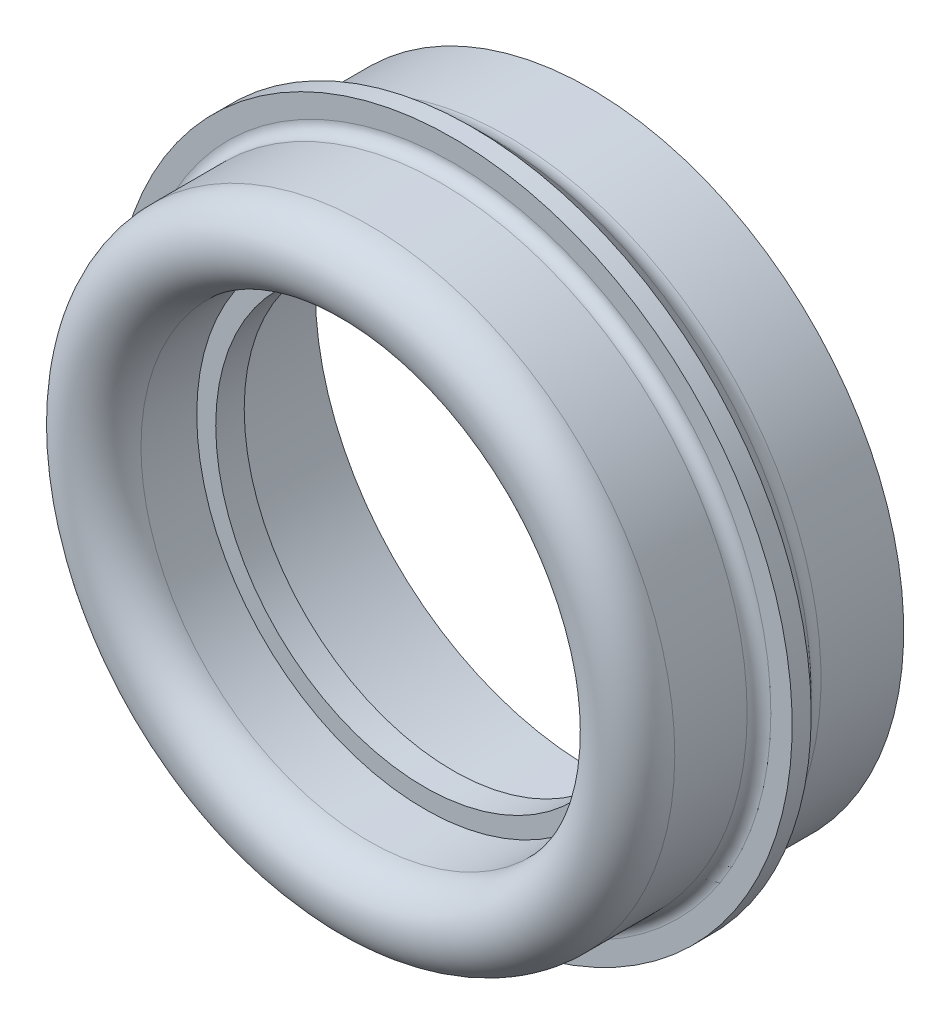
ISO-10303-21;
HEADER;
FILE_DESCRIPTION(('STEP AP214'),'2;1');
FILE_NAME('part.step','',(''),(''),'','','');
FILE_SCHEMA(('AUTOMOTIVE_DESIGN { 1 0 10303 214 1 1 1 1 }'));
ENDSEC;
DATA;
#1=APPLICATION_CONTEXT('core data for automotive mechanical design processes');
#2=APPLICATION_PROTOCOL_DEFINITION('international standard','automotive_design',2000,#1);
#3=PRODUCT_CONTEXT('',#1,'mechanical');
#4=PRODUCT('Part','Part','',(#3));
#5=PRODUCT_RELATED_PRODUCT_CATEGORY('part','',(#4));
#6=PRODUCT_DEFINITION_FORMATION('','',#4);
#7=PRODUCT_DEFINITION_CONTEXT('part definition',#1,'design');
#8=PRODUCT_DEFINITION('design','',#6,#7);
#9=PRODUCT_DEFINITION_SHAPE('','',#8);
#10=(LENGTH_UNIT() NAMED_UNIT(*) SI_UNIT(.MILLI.,.METRE.));
#11=(NAMED_UNIT(*) PLANE_ANGLE_UNIT() SI_UNIT($,.RADIAN.));
#12=(NAMED_UNIT(*) SI_UNIT($,.STERADIAN.) SOLID_ANGLE_UNIT());
#13=UNCERTAINTY_MEASURE_WITH_UNIT(LENGTH_MEASURE(1.E-05),#10,'distance_accuracy_value','');
#14=(GEOMETRIC_REPRESENTATION_CONTEXT(3) GLOBAL_UNCERTAINTY_ASSIGNED_CONTEXT((#13)) GLOBAL_UNIT_ASSIGNED_CONTEXT((#10,
#11,#12)) REPRESENTATION_CONTEXT('',''));
#15=CARTESIAN_POINT('',(0.,0.,0.));
#16=DIRECTION('',(0.,0.,1.));
#17=DIRECTION('',(1.,0.,0.));
#18=AXIS2_PLACEMENT_3D('',#15,#16,#17);
#19=CARTESIAN_POINT('',(0.,0.,16.4447054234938));
#20=DIRECTION('',(0.,0.,1.));
#21=DIRECTION('',(0.960132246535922,0.27954618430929,0.));
#22=AXIS2_PLACEMENT_3D('',#19,#20,#21);
#23=TOROIDAL_SURFACE('',#22,6.3,0.5);
#24=CARTESIAN_POINT('',(0.,0.,16.4447054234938));
#25=DIRECTION('',(0.,0.,-1.));
#26=DIRECTION('',(-1.,0.,0.));
#27=AXIS2_PLACEMENT_3D('',#24,#25,#26);
#28=CIRCLE('',#27,5.8);
#29=CARTESIAN_POINT('',(-5.8,0.,16.4447054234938));
#30=VERTEX_POINT('',#29);
#31=EDGE_CURVE('E166',#30,#30,#28,.T.);
#32=ORIENTED_EDGE('',*,*,#31,.T.);
#33=EDGE_LOOP('',(#32));
#34=FACE_BOUND('',#33,.T.);
#35=CARTESIAN_POINT('',(0.,0.,16.6973717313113));
#36=DIRECTION('',(0.,0.,1.));
#37=DIRECTION('',(0.960132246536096,0.279546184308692,0.));
#38=AXIS2_PLACEMENT_3D('',#35,#36,#37);
#39=CIRCLE('',#38,5.868537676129);
#40=CARTESIAN_POINT('',(5.63457226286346,1.64052731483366,16.6973717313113));
#41=VERTEX_POINT('',#40);
#42=EDGE_CURVE('E163',#41,#41,#39,.T.);
#43=ORIENTED_EDGE('',*,*,#42,.T.);
#44=EDGE_LOOP('',(#43));
#45=FACE_BOUND('',#44,.T.);
#46=ADVANCED_FACE('F12',(#34,#45),#23,.T.);
#47=CARTESIAN_POINT('',(0.,0.,-43.3638504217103));
#48=DIRECTION('',(0.,0.,-1.));
#49=DIRECTION('',(-1.,0.,0.));
#50=AXIS2_PLACEMENT_3D('',#47,#48,#49);
#51=CYLINDRICAL_SURFACE('',#50,5.8);
#52=ORIENTED_EDGE('',*,*,#31,.F.);
#53=EDGE_LOOP('',(#52));
#54=FACE_BOUND('',#53,.T.);
#55=CARTESIAN_POINT('',(0.,0.,14.5));
#56=DIRECTION('',(0.,0.,-1.));
#57=DIRECTION('',(-1.,0.,0.));
#58=AXIS2_PLACEMENT_3D('',#55,#56,#57);
#59=CIRCLE('',#58,5.8);
#60=CARTESIAN_POINT('',(-5.8,0.,14.5));
#61=VERTEX_POINT('',#60);
#62=EDGE_CURVE('E16',#61,#61,#59,.F.);
#63=ORIENTED_EDGE('',*,*,#62,.F.);
#64=EDGE_LOOP('',(#63));
#65=FACE_BOUND('',#64,.T.);
#66=ADVANCED_FACE('F110',(#54,#65),#51,.F.);
#67=CARTESIAN_POINT('',(0.,0.,17.2317334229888));
#68=DIRECTION('',(0.,0.,1.));
#69=DIRECTION('',(1.,0.,0.));
#70=AXIS2_PLACEMENT_3D('',#67,#68,#69);
#71=CONICAL_SURFACE('',#70,6.18146232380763,0.529767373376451);
#72=CARTESIAN_POINT('',(0.,0.,17.2317334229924));
#73=DIRECTION('',(0.,0.,-1.));
#74=DIRECTION('',(-0.960132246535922,-0.27954618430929,0.));
#75=AXIS2_PLACEMENT_3D('',#72,#73,#74);
#76=CIRCLE('',#75,6.18146232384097);
#77=CARTESIAN_POINT('',(-5.93502130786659,-1.72800420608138,17.2317334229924));
#78=VERTEX_POINT('',#77);
#79=EDGE_CURVE('E96',#78,#78,#76,.F.);
#80=ORIENTED_EDGE('',*,*,#79,.T.);
#81=EDGE_LOOP('',(#80));
#82=FACE_BOUND('',#81,.T.);
#83=ORIENTED_EDGE('',*,*,#42,.F.);
#84=EDGE_LOOP('',(#83));
#85=FACE_BOUND('',#84,.T.);
#86=ADVANCED_FACE('F107',(#82,#85),#71,.F.);
#87=CARTESIAN_POINT('',(1.62136786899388,-5.56876702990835,14.5));
#88=DIRECTION('',(0.,0.,-1.));
#89=DIRECTION('',(-1.,0.,0.));
#90=AXIS2_PLACEMENT_3D('',#87,#88,#89);
#91=PLANE('',#90);
#92=ORIENTED_EDGE('',*,*,#62,.T.);
#93=EDGE_LOOP('',(#92));
#94=FACE_BOUND('',#93,.T.);
#95=CARTESIAN_POINT('',(0.,0.,14.5));
#96=DIRECTION('',(0.,0.,-1.));
#97=DIRECTION('',(-1.,0.,0.));
#98=AXIS2_PLACEMENT_3D('',#95,#96,#97);
#99=CIRCLE('',#98,6.6);
#100=CARTESIAN_POINT('',(-6.6,0.,14.5));
#101=VERTEX_POINT('',#100);
#102=EDGE_CURVE('E93',#101,#101,#99,.F.);
#103=ORIENTED_EDGE('',*,*,#102,.F.);
#104=EDGE_LOOP('',(#103));
#105=FACE_BOUND('',#104,.T.);
#106=ADVANCED_FACE('F103',(#94,#105),#91,.T.);
#107=CARTESIAN_POINT('',(0.,0.,17.4843997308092));
#108=DIRECTION('',(0.,0.,-1.));
#109=DIRECTION('',(-0.960132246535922,-0.27954618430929,0.));
#110=AXIS2_PLACEMENT_3D('',#107,#108,#109);
#111=TOROIDAL_SURFACE('',#110,5.75,0.5);
#112=ORIENTED_EDGE('',*,*,#79,.F.);
#113=EDGE_LOOP('',(#112));
#114=FACE_BOUND('',#113,.T.);
#115=CARTESIAN_POINT('',(0.,0.,17.4843997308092));
#116=DIRECTION('',(0.,0.,-1.));
#117=DIRECTION('',(-1.,0.,0.));
#118=AXIS2_PLACEMENT_3D('',#115,#116,#117);
#119=CIRCLE('',#118,6.25);
#120=CARTESIAN_POINT('',(-6.25,0.,17.4843997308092));
#121=VERTEX_POINT('',#120);
#122=EDGE_CURVE('E89',#121,#121,#119,.F.);
#123=ORIENTED_EDGE('',*,*,#122,.T.);
#124=EDGE_LOOP('',(#123));
#125=FACE_BOUND('',#124,.T.);
#126=ADVANCED_FACE('F99',(#114,#125),#111,.F.);
#127=CARTESIAN_POINT('',(0.,0.,-43.3638504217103));
#128=DIRECTION('',(0.,0.,-1.));
#129=DIRECTION('',(-1.,0.,0.));
#130=AXIS2_PLACEMENT_3D('',#127,#128,#129);
#131=CYLINDRICAL_SURFACE('',#130,6.6);
#132=CARTESIAN_POINT('',(0.,0.,16.2428932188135));
#133=DIRECTION('',(0.,0.,-1.));
#134=DIRECTION('',(-0.960132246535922,-0.27954618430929,0.));
#135=AXIS2_PLACEMENT_3D('',#132,#133,#134);
#136=CIRCLE('',#135,6.6);
#137=CARTESIAN_POINT('',(-6.33687282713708,-1.84500481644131,16.2428932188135));
#138=VERTEX_POINT('',#137);
#139=EDGE_CURVE('E92',#138,#138,#136,.T.);
#140=ORIENTED_EDGE('',*,*,#139,.T.);
#141=EDGE_LOOP('',(#140));
#142=FACE_BOUND('',#141,.T.);
#143=ORIENTED_EDGE('',*,*,#102,.T.);
#144=EDGE_LOOP('',(#143));
#145=FACE_BOUND('',#144,.T.);
#146=ADVANCED_FACE('F102',(#142,#145),#131,.T.);
#147=CARTESIAN_POINT('',(0.,0.,-43.3638504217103));
#148=DIRECTION('',(0.,0.,-1.));
#149=DIRECTION('',(-1.,0.,0.));
#150=AXIS2_PLACEMENT_3D('',#147,#148,#149);
#151=CYLINDRICAL_SURFACE('',#150,6.25);
#152=ORIENTED_EDGE('',*,*,#122,.F.);
#153=EDGE_LOOP('',(#152));
#154=FACE_BOUND('',#153,.T.);
#155=CARTESIAN_POINT('',(0.,0.,19.175));
#156=DIRECTION('',(0.,0.,-1.));
#157=DIRECTION('',(-0.960132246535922,-0.27954618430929,0.));
#158=AXIS2_PLACEMENT_3D('',#155,#156,#157);
#159=CIRCLE('',#158,6.25);
#160=CARTESIAN_POINT('',(-6.00082654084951,-1.74716365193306,19.175));
#161=VERTEX_POINT('',#160);
#162=EDGE_CURVE('E67',#161,#161,#159,.F.);
#163=ORIENTED_EDGE('',*,*,#162,.T.);
#164=EDGE_LOOP('',(#163));
#165=FACE_BOUND('',#164,.T.);
#166=ADVANCED_FACE('F81',(#154,#165),#151,.F.);
#167=CARTESIAN_POINT('',(0.,0.,16.2428932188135));
#168=DIRECTION('',(0.,0.,-1.));
#169=DIRECTION('',(-0.960132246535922,-0.27954618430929,0.));
#170=AXIS2_PLACEMENT_3D('',#167,#168,#169);
#171=TOROIDAL_SURFACE('',#170,7.1,0.5);
#172=CARTESIAN_POINT('',(0.,0.,16.5964466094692));
#173=DIRECTION('',(0.,0.,1.));
#174=DIRECTION('',(0.960132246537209,0.279546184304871,0.));
#175=AXIS2_PLACEMENT_3D('',#172,#173,#174);
#176=CIRCLE('',#175,6.7464466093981);
#177=CARTESIAN_POINT('',(6.47748093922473,1.88594340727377,16.5964466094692));
#178=VERTEX_POINT('',#177);
#179=EDGE_CURVE('E86',#178,#178,#176,.T.);
#180=ORIENTED_EDGE('',*,*,#179,.F.);
#181=EDGE_LOOP('',(#180));
#182=FACE_BOUND('',#181,.T.);
#183=ORIENTED_EDGE('',*,*,#139,.F.);
#184=EDGE_LOOP('',(#183));
#185=FACE_BOUND('',#184,.T.);
#186=ADVANCED_FACE('F75',(#182,#185),#171,.F.);
#187=CARTESIAN_POINT('',(0.,0.,19.175));
#188=DIRECTION('',(0.,0.,-1.));
#189=DIRECTION('',(-0.960132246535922,-0.27954618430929,0.));
#190=AXIS2_PLACEMENT_3D('',#187,#188,#189);
#191=TOROIDAL_SURFACE('',#190,5.625,0.625);
#192=ORIENTED_EDGE('',*,*,#162,.F.);
#193=EDGE_LOOP('',(#192));
#194=FACE_BOUND('',#193,.T.);
#195=CARTESIAN_POINT('',(0.,0.,19.175));
#196=DIRECTION('',(0.,0.,-1.));
#197=DIRECTION('',(-1.,0.,0.));
#198=AXIS2_PLACEMENT_3D('',#195,#196,#197);
#199=CIRCLE('',#198,5.);
#200=CARTESIAN_POINT('',(-5.,0.,19.175));
#201=VERTEX_POINT('',#200);
#202=EDGE_CURVE('E64',#201,#201,#199,.T.);
#203=ORIENTED_EDGE('',*,*,#202,.F.);
#204=EDGE_LOOP('',(#203));
#205=FACE_BOUND('',#204,.T.);
#206=ADVANCED_FACE('F70',(#194,#205),#191,.F.);
#207=CARTESIAN_POINT('',(0.,0.,16.9999999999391));
#208=DIRECTION('',(0.,0.,1.));
#209=DIRECTION('',(1.,0.,0.));
#210=AXIS2_PLACEMENT_3D('',#207,#208,#209);
#211=CONICAL_SURFACE('',#210,7.14999999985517,0.785398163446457);
#212=CARTESIAN_POINT('',(0.,0.,17.));
#213=DIRECTION('',(0.,0.,-1.));
#214=DIRECTION('',(-1.,0.,0.));
#215=AXIS2_PLACEMENT_3D('',#212,#213,#214);
#216=CIRCLE('',#215,7.15);
#217=CARTESIAN_POINT('',(-7.15,0.,17.));
#218=VERTEX_POINT('',#217);
#219=EDGE_CURVE('E55',#218,#218,#216,.F.);
#220=ORIENTED_EDGE('',*,*,#219,.F.);
#221=EDGE_LOOP('',(#220));
#222=FACE_BOUND('',#221,.T.);
#223=ORIENTED_EDGE('',*,*,#179,.T.);
#224=EDGE_LOOP('',(#223));
#225=FACE_BOUND('',#224,.T.);
#226=ADVANCED_FACE('F74',(#222,#225),#211,.T.);
#227=CARTESIAN_POINT('',(0.,0.,-43.3638504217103));
#228=DIRECTION('',(0.,0.,-1.));
#229=DIRECTION('',(-1.,0.,0.));
#230=AXIS2_PLACEMENT_3D('',#227,#228,#229);
#231=CYLINDRICAL_SURFACE('',#230,5.);
#232=CARTESIAN_POINT('',(0.,0.,17.4));
#233=DIRECTION('',(0.,0.,-1.));
#234=DIRECTION('',(-1.,0.,0.));
#235=AXIS2_PLACEMENT_3D('',#232,#233,#234);
#236=CIRCLE('',#235,5.);
#237=CARTESIAN_POINT('',(-5.,0.,17.4));
#238=VERTEX_POINT('',#237);
#239=EDGE_CURVE('E63',#238,#238,#236,.T.);
#240=ORIENTED_EDGE('',*,*,#239,.F.);
#241=EDGE_LOOP('',(#240));
#242=FACE_BOUND('',#241,.T.);
#243=ORIENTED_EDGE('',*,*,#202,.T.);
#244=EDGE_LOOP('',(#243));
#245=FACE_BOUND('',#244,.T.);
#246=ADVANCED_FACE('F187',(#242,#245),#231,.T.);
#247=CARTESIAN_POINT('',(0.,0.,-43.3638504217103));
#248=DIRECTION('',(0.,0.,-1.));
#249=DIRECTION('',(-1.,0.,0.));
#250=AXIS2_PLACEMENT_3D('',#247,#248,#249);
#251=CYLINDRICAL_SURFACE('',#250,7.15);
#252=ORIENTED_EDGE('',*,*,#219,.T.);
#253=EDGE_LOOP('',(#252));
#254=FACE_BOUND('',#253,.T.);
#255=CARTESIAN_POINT('',(0.,0.,17.4));
#256=DIRECTION('',(0.,0.,-1.));
#257=DIRECTION('',(-1.,0.,0.));
#258=AXIS2_PLACEMENT_3D('',#255,#256,#257);
#259=CIRCLE('',#258,7.15);
#260=CARTESIAN_POINT('',(-7.15,0.,17.4));
#261=VERTEX_POINT('',#260);
#262=EDGE_CURVE('E148',#261,#261,#259,.F.);
#263=ORIENTED_EDGE('',*,*,#262,.F.);
#264=EDGE_LOOP('',(#263));
#265=FACE_BOUND('',#264,.T.);
#266=ADVANCED_FACE('F189',(#254,#265),#251,.T.);
#267=CARTESIAN_POINT('',(1.39773092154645,-4.80066123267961,17.4));
#268=DIRECTION('',(0.,0.,-1.));
#269=DIRECTION('',(-1.,0.,0.));
#270=AXIS2_PLACEMENT_3D('',#267,#268,#269);
#271=PLANE('',#270);
#272=CARTESIAN_POINT('',(0.,0.,17.4));
#273=DIRECTION('',(0.,0.,-1.));
#274=DIRECTION('',(-1.,0.,0.));
#275=AXIS2_PLACEMENT_3D('',#272,#273,#274);
#276=CIRCLE('',#275,4.4);
#277=CARTESIAN_POINT('',(-4.4,0.,17.4));
#278=VERTEX_POINT('',#277);
#279=EDGE_CURVE('E144',#278,#278,#276,.F.);
#280=ORIENTED_EDGE('',*,*,#279,.T.);
#281=EDGE_LOOP('',(#280));
#282=FACE_BOUND('',#281,.T.);
#283=ORIENTED_EDGE('',*,*,#239,.T.);
#284=EDGE_LOOP('',(#283));
#285=FACE_BOUND('',#284,.T.);
#286=ADVANCED_FACE('F195',(#282,#285),#271,.T.);
#287=CARTESIAN_POINT('',(1.99875521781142,-6.86494556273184,17.4));
#288=DIRECTION('',(0.,0.,1.));
#289=DIRECTION('',(0.,-1.,0.));
#290=AXIS2_PLACEMENT_3D('',#287,#288,#289);
#291=PLANE('',#290);
#292=CARTESIAN_POINT('',(0.,0.,17.4));
#293=DIRECTION('',(0.,0.,1.));
#294=DIRECTION('',(0.960132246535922,0.27954618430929,0.));
#295=AXIS2_PLACEMENT_3D('',#292,#293,#294);
#296=CIRCLE('',#295,6.7);
#297=CARTESIAN_POINT('',(6.43288605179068,1.87295943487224,17.4));
#298=VERTEX_POINT('',#297);
#299=EDGE_CURVE('E142',#298,#298,#296,.F.);
#300=ORIENTED_EDGE('',*,*,#299,.T.);
#301=EDGE_LOOP('',(#300));
#302=FACE_BOUND('',#301,.T.);
#303=ORIENTED_EDGE('',*,*,#262,.T.);
#304=EDGE_LOOP('',(#303));
#305=FACE_BOUND('',#304,.T.);
#306=ADVANCED_FACE('F202',(#302,#305),#291,.T.);
#307=CARTESIAN_POINT('',(0.,0.,-43.3638504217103));
#308=DIRECTION('',(0.,0.,-1.));
#309=DIRECTION('',(-1.,0.,0.));
#310=AXIS2_PLACEMENT_3D('',#307,#308,#309);
#311=CYLINDRICAL_SURFACE('',#310,4.4);
#312=CARTESIAN_POINT('',(0.,0.,18.));
#313=DIRECTION('',(0.,0.,-1.));
#314=DIRECTION('',(-1.,0.,0.));
#315=AXIS2_PLACEMENT_3D('',#312,#313,#314);
#316=CIRCLE('',#315,4.4);
#317=CARTESIAN_POINT('',(-4.4,0.,18.));
#318=VERTEX_POINT('',#317);
#319=EDGE_CURVE('E33',#318,#318,#316,.T.);
#320=ORIENTED_EDGE('',*,*,#319,.F.);
#321=EDGE_LOOP('',(#320));
#322=FACE_BOUND('',#321,.T.);
#323=ORIENTED_EDGE('',*,*,#279,.F.);
#324=EDGE_LOOP('',(#323));
#325=FACE_BOUND('',#324,.T.);
#326=ADVANCED_FACE('F45',(#322,#325),#311,.F.);
#327=CARTESIAN_POINT('',(0.,0.,17.65));
#328=DIRECTION('',(0.,0.,1.));
#329=DIRECTION('',(0.960132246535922,0.27954618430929,0.));
#330=AXIS2_PLACEMENT_3D('',#327,#328,#329);
#331=TOROIDAL_SURFACE('',#330,6.7,0.25);
#332=CARTESIAN_POINT('',(0.,0.,17.65));
#333=DIRECTION('',(0.,0.,-1.));
#334=DIRECTION('',(-1.,0.,0.));
#335=AXIS2_PLACEMENT_3D('',#332,#333,#334);
#336=CIRCLE('',#335,6.45);
#337=CARTESIAN_POINT('',(-6.45,0.,17.65));
#338=VERTEX_POINT('',#337);
#339=EDGE_CURVE('E30',#338,#338,#336,.F.);
#340=ORIENTED_EDGE('',*,*,#339,.F.);
#341=EDGE_LOOP('',(#340));
#342=FACE_BOUND('',#341,.T.);
#343=ORIENTED_EDGE('',*,*,#299,.F.);
#344=EDGE_LOOP('',(#343));
#345=FACE_BOUND('',#344,.T.);
#346=ADVANCED_FACE('F39',(#342,#345),#331,.F.);
#347=CARTESIAN_POINT('',(1.23000321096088,-4.22458188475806,18.));
#348=DIRECTION('',(0.,0.,1.));
#349=DIRECTION('',(0.,-1.,0.));
#350=AXIS2_PLACEMENT_3D('',#347,#348,#349);
#351=PLANE('',#350);
#352=ORIENTED_EDGE('',*,*,#319,.T.);
#353=EDGE_LOOP('',(#352));
#354=FACE_BOUND('',#353,.T.);
#355=CARTESIAN_POINT('',(0.,0.,18.));
#356=DIRECTION('',(0.,0.,-1.));
#357=DIRECTION('',(-1.,0.,0.));
#358=AXIS2_PLACEMENT_3D('',#355,#356,#357);
#359=CIRCLE('',#358,4.8);
#360=CARTESIAN_POINT('',(-4.8,0.,18.));
#361=VERTEX_POINT('',#360);
#362=EDGE_CURVE('E25',#361,#361,#359,.F.);
#363=ORIENTED_EDGE('',*,*,#362,.T.);
#364=EDGE_LOOP('',(#363));
#365=FACE_BOUND('',#364,.T.);
#366=ADVANCED_FACE('F44',(#354,#365),#351,.T.);
#367=CARTESIAN_POINT('',(0.,0.,-43.3638504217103));
#368=DIRECTION('',(0.,0.,-1.));
#369=DIRECTION('',(-1.,0.,0.));
#370=AXIS2_PLACEMENT_3D('',#367,#368,#369);
#371=CYLINDRICAL_SURFACE('',#370,6.45);
#372=ORIENTED_EDGE('',*,*,#339,.T.);
#373=EDGE_LOOP('',(#372));
#374=FACE_BOUND('',#373,.T.);
#375=CARTESIAN_POINT('',(0.,0.,19.175));
#376=DIRECTION('',(0.,0.,-1.));
#377=DIRECTION('',(-0.960132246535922,-0.27954618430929,0.));
#378=AXIS2_PLACEMENT_3D('',#375,#376,#377);
#379=CIRCLE('',#378,6.45);
#380=CARTESIAN_POINT('',(-6.19285299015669,-1.80307288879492,19.175));
#381=VERTEX_POINT('',#380);
#382=EDGE_CURVE('E20',#381,#381,#379,.F.);
#383=ORIENTED_EDGE('',*,*,#382,.F.);
#384=EDGE_LOOP('',(#383));
#385=FACE_BOUND('',#384,.T.);
#386=ADVANCED_FACE('F128',(#374,#385),#371,.T.);
#387=CARTESIAN_POINT('',(0.,0.,-43.3638504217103));
#388=DIRECTION('',(0.,0.,-1.));
#389=DIRECTION('',(-1.,0.,0.));
#390=AXIS2_PLACEMENT_3D('',#387,#388,#389);
#391=CYLINDRICAL_SURFACE('',#390,4.8);
#392=CARTESIAN_POINT('',(0.,0.,19.175));
#393=DIRECTION('',(0.,0.,-1.));
#394=DIRECTION('',(-0.960132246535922,-0.27954618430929,0.));
#395=AXIS2_PLACEMENT_3D('',#392,#393,#394);
#396=CIRCLE('',#395,4.8);
#397=CARTESIAN_POINT('',(-4.60863478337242,-1.34182168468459,19.175));
#398=VERTEX_POINT('',#397);
#399=EDGE_CURVE('E8',#398,#398,#396,.T.);
#400=ORIENTED_EDGE('',*,*,#399,.F.);
#401=EDGE_LOOP('',(#400));
#402=FACE_BOUND('',#401,.T.);
#403=ORIENTED_EDGE('',*,*,#362,.F.);
#404=EDGE_LOOP('',(#403));
#405=FACE_BOUND('',#404,.T.);
#406=ADVANCED_FACE('F123',(#402,#405),#391,.F.);
#407=CARTESIAN_POINT('',(0.,0.,19.175));
#408=DIRECTION('',(0.,0.,-1.));
#409=DIRECTION('',(-0.960132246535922,-0.27954618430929,0.));
#410=AXIS2_PLACEMENT_3D('',#407,#408,#409);
#411=TOROIDAL_SURFACE('',#410,5.625,0.825);
#412=ORIENTED_EDGE('',*,*,#399,.T.);
#413=EDGE_LOOP('',(#412));
#414=FACE_BOUND('',#413,.T.);
#415=ORIENTED_EDGE('',*,*,#382,.T.);
#416=EDGE_LOOP('',(#415));
#417=FACE_BOUND('',#416,.T.);
#418=ADVANCED_FACE('F121',(#414,#417),#411,.T.);
#419=CLOSED_SHELL('',(#46,#66,#86,#106,#126,#146,#166,#186,#206,#226,#246,#266,#286,#306,#326,
#346,#366,#386,#406,#418));
#420=MANIFOLD_SOLID_BREP('B1',#419);
#421=ADVANCED_BREP_SHAPE_REPRESENTATION('',(#18,#420),#14);
#422=SHAPE_DEFINITION_REPRESENTATION(#9,#421);
ENDSEC;
END-ISO-10303-21;
